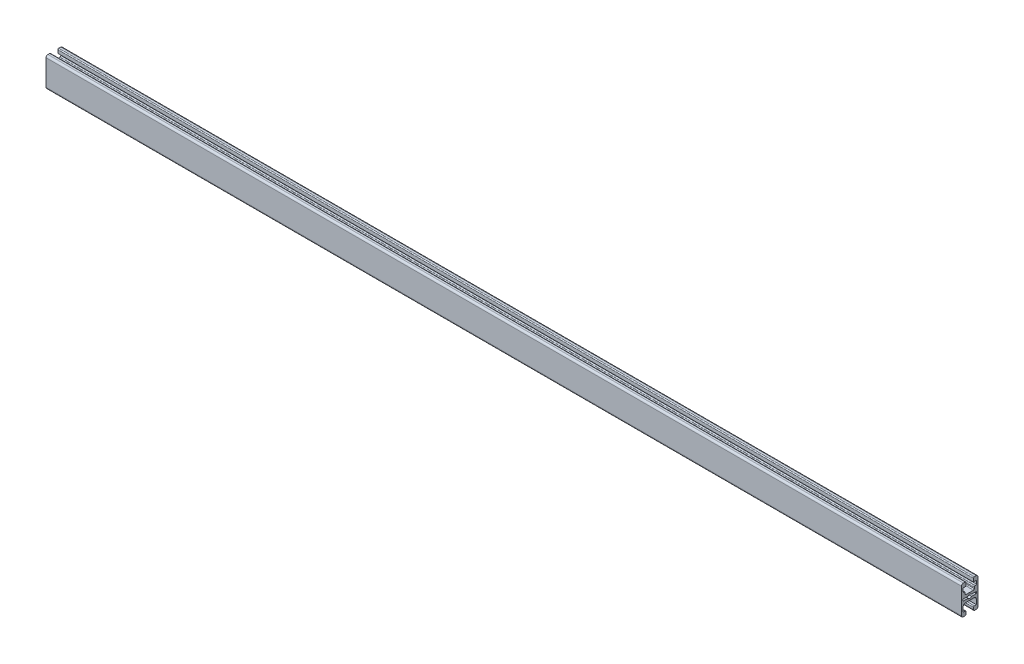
from build123d import *

# Parameters (mm, degrees)
STRUKTURBAUTEIL1_DEPTH = 1000


with BuildPart() as part:
    # Model → Strukturbauteil1 (new body)
    with BuildSketch(Plane(origin=(0, 0, 0), x_dir=(0, 0, -1), z_dir=(1, 0, 0))):
        with BuildLine():
            Line((-9, -14), (-9, 14))
            ThreePointArc((-9, 14), (-8.414213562, 15.414213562), (-7, 16))
            Line((-7, 16), (-5, 16))
            ThreePointArc((-5, 16), (-4.292893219, 15.707106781), (-4, 15))
            Line((-4, 15), (-4, 11.5))
            Line((-4, 11.5), (-7.175, 11.5))
            Line((-7.175, 11.5), (-7.175, 8))
            ThreePointArc((-7.175, 8), (-6.882106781, 7.292893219), (-6.175, 7))
            Line((-6.175, 7), (-6, 7))
            ThreePointArc((-6, 7), (-5.292893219, 6.707106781), (-5, 6))
            Line((-5, 6), (-5, 4.75))
            ThreePointArc((-5, 4.75), (-4.707106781, 4.042893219), (-4, 3.75))
            Line((-4, 3.75), (4, 3.75))
            ThreePointArc((4, 3.75), (4.707106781, 4.042893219), (5, 4.75))
            Line((5, 4.75), (5, 6))
            ThreePointArc((5, 6), (5.292893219, 6.707106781), (6, 7))
            Line((6, 7), (6.175, 7))
            ThreePointArc((6.175, 7), (6.882106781, 7.292893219), (7.175, 8))
            Line((7.175, 8), (7.175, 11.5))
            Line((7.175, 11.5), (4, 11.5))
            Line((4, 11.5), (4, 15))
            ThreePointArc((4, 15), (4.292893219, 15.707106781), (5, 16))
            Line((5, 16), (7, 16))
            ThreePointArc((7, 16), (8.414213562, 15.414213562), (9, 14))
            Line((9, 14), (9, -14))
            ThreePointArc((9, -14), (8.414213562, -15.414213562), (7, -16))
            Line((7, -16), (5.5, -16))
            ThreePointArc((5.5, -16), (4.439339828, -15.560660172), (4, -14.5))
            Line((4, -14.5), (4, -12.5))
            ThreePointArc((4, -12.5), (4.292893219, -11.792893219), (5, -11.5))
            Line((5, -11.5), (7.175, -11.5))
            Line((7.175, -11.5), (7.175, -6.25))
            ThreePointArc((7.175, -6.25), (6.442766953, -4.482233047), (4.675, -3.75))
            Line((4.675, -3.75), (-4.675, -3.75))
            ThreePointArc((-4.675, -3.75), (-6.442766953, -4.482233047), (-7.175, -6.25))
            Line((-7.175, -6.25), (-7.175, -11.5))
            Line((-7.175, -11.5), (-5, -11.5))
            ThreePointArc((-5, -11.5), (-4.292893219, -11.792893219), (-4, -12.5))
            Line((-4, -12.5), (-4, -14.5))
            ThreePointArc((-4, -14.5), (-4.439339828, -15.560660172), (-5.5, -16))
            Line((-5.5, -16), (-7, -16))
            ThreePointArc((-7, -16), (-8.414213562, -15.414213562), (-9, -14))
        make_face()
        with BuildLine():
            Line((-1.846618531, -1), (-7.175, -1))
            Line((-7.175, -1), (-7.175, 1))
            Line((-7.175, 1), (-1.846618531, 1))
            ThreePointArc((-1.846618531, 1), (0, 2.1), (1.846618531, 1))
            Line((1.846618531, 1), (7.175, 1))
            Line((7.175, 1), (7.175, -1))
            Line((7.175, -1), (1.846618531, -1))
            ThreePointArc((1.846618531, -1), (0, -2.1), (-1.846618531, -1))
        make_face(mode=Mode.SUBTRACT)
    extrude(amount=STRUKTURBAUTEIL1_DEPTH)


solid = part.part
